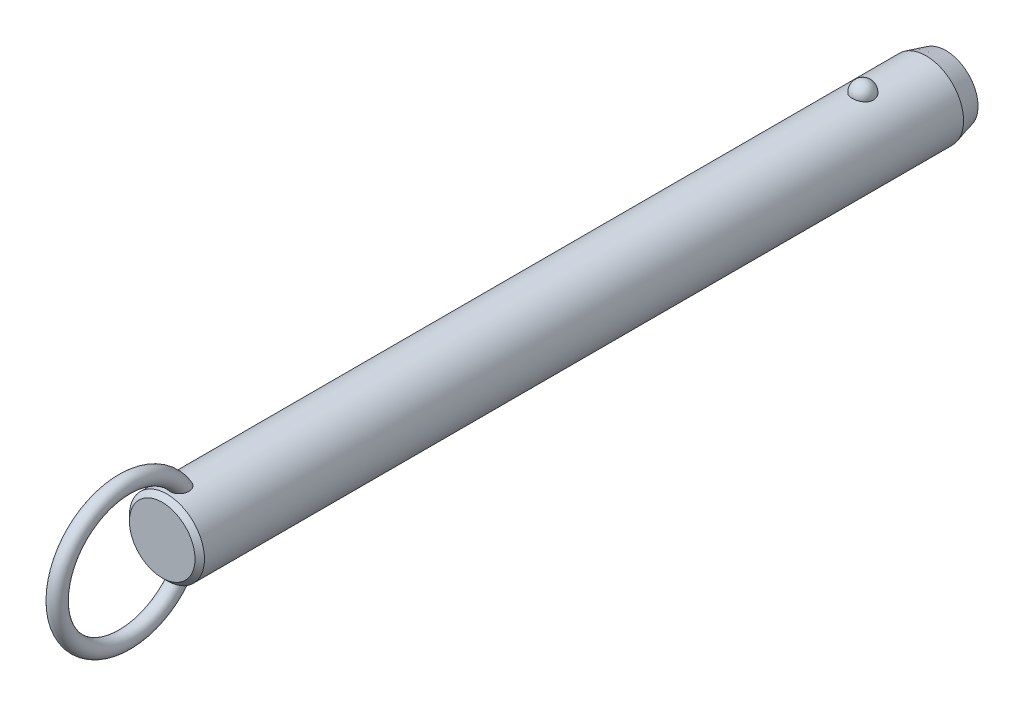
ISO-10303-21;
HEADER;
FILE_DESCRIPTION(('STEP AP214'),'2;1');
FILE_NAME('part.step','',(''),(''),'','','');
FILE_SCHEMA(('AUTOMOTIVE_DESIGN { 1 0 10303 214 1 1 1 1 }'));
ENDSEC;
DATA;
#1=APPLICATION_CONTEXT('core data for automotive mechanical design processes');
#2=APPLICATION_PROTOCOL_DEFINITION('international standard','automotive_design',2000,#1);
#3=PRODUCT_CONTEXT('',#1,'mechanical');
#4=PRODUCT('Part','Part','',(#3));
#5=PRODUCT_RELATED_PRODUCT_CATEGORY('part','',(#4));
#6=PRODUCT_DEFINITION_FORMATION('','',#4);
#7=PRODUCT_DEFINITION_CONTEXT('part definition',#1,'design');
#8=PRODUCT_DEFINITION('design','',#6,#7);
#9=PRODUCT_DEFINITION_SHAPE('','',#8);
#10=(LENGTH_UNIT() NAMED_UNIT(*) SI_UNIT(.MILLI.,.METRE.));
#11=(NAMED_UNIT(*) PLANE_ANGLE_UNIT() SI_UNIT($,.RADIAN.));
#12=(NAMED_UNIT(*) SI_UNIT($,.STERADIAN.) SOLID_ANGLE_UNIT());
#13=UNCERTAINTY_MEASURE_WITH_UNIT(LENGTH_MEASURE(1.E-05),#10,'distance_accuracy_value','');
#14=(GEOMETRIC_REPRESENTATION_CONTEXT(3) GLOBAL_UNCERTAINTY_ASSIGNED_CONTEXT((#13)) GLOBAL_UNIT_ASSIGNED_CONTEXT((#10,
#11,#12)) REPRESENTATION_CONTEXT('',''));
#15=CARTESIAN_POINT('',(0.,0.,0.));
#16=DIRECTION('',(0.,0.,1.));
#17=DIRECTION('',(1.,0.,0.));
#18=AXIS2_PLACEMENT_3D('',#15,#16,#17);
#19=CARTESIAN_POINT('',(0.,0.,165.1));
#20=DIRECTION('',(0.,0.,-1.));
#21=DIRECTION('',(-1.,0.,0.));
#22=AXIS2_PLACEMENT_3D('',#19,#20,#21);
#23=CYLINDRICAL_SURFACE('',#22,9.5);
#24=CARTESIAN_POINT('',(2.67259918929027,9.11631578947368,-2.70000000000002));
#25=CARTESIAN_POINT('',(2.6725968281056,9.11631786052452,-2.54909854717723));
#26=CARTESIAN_POINT('',(2.66030567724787,9.11994722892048,-2.39816735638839));
#27=CARTESIAN_POINT('',(2.6114347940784,9.13405924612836,-2.10058568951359));
#28=CARTESIAN_POINT('',(2.57484658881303,9.14454428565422,-1.95393672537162));
#29=CARTESIAN_POINT('',(2.47830875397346,9.17117631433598,-1.66916069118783));
#30=CARTESIAN_POINT('',(2.41836936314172,9.18732082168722,-1.53102991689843));
#31=CARTESIAN_POINT('',(2.27661331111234,9.22346780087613,-1.26705393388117));
#32=CARTESIAN_POINT('',(2.19479699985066,9.24347021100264,-1.14120852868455));
#33=CARTESIAN_POINT('',(2.01085282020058,9.28522401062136,-0.904632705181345));
#34=CARTESIAN_POINT('',(1.90862396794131,9.30698376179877,-0.79398224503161));
#35=CARTESIAN_POINT('',(1.6867437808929,9.34973971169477,-0.591607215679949));
#36=CARTESIAN_POINT('',(1.56709244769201,9.37073591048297,-0.499882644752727));
#37=CARTESIAN_POINT('',(1.31393976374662,9.40956370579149,-0.338167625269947));
#38=CARTESIAN_POINT('',(1.18048026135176,9.42740444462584,-0.268113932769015));
#39=CARTESIAN_POINT('',(0.903154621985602,9.45799906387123,-0.151390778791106));
#40=CARTESIAN_POINT('',(0.759289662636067,9.47075351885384,-0.104718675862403));
#41=CARTESIAN_POINT('',(0.46807402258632,9.48956256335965,-0.0367633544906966));
#42=CARTESIAN_POINT('',(0.320836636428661,9.49573643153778,-0.0150275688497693));
#43=CARTESIAN_POINT('',(0.0246714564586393,9.50112183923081,0.0039619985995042));
#44=CARTESIAN_POINT('',(-0.124256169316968,9.50033406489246,0.00121819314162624));
#45=CARTESIAN_POINT('',(-0.417264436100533,9.4919475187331,-0.0284441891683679));
#46=CARTESIAN_POINT('',(-0.561384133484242,9.48444885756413,-0.0550074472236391));
#47=CARTESIAN_POINT('',(-0.842986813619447,9.46357853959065,-0.131064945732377));
#48=CARTESIAN_POINT('',(-0.98046968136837,9.450206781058,-0.180559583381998));
#49=CARTESIAN_POINT('',(-1.24585005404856,9.41890822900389,-0.301476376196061));
#50=CARTESIAN_POINT('',(-1.37368611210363,9.40095498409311,-0.373026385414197));
#51=CARTESIAN_POINT('',(-1.61552738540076,9.36242964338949,-0.53602540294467));
#52=CARTESIAN_POINT('',(-1.72953116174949,9.34185727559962,-0.627476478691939));
#53=CARTESIAN_POINT('',(-1.9429225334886,9.29984568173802,-0.829844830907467));
#54=CARTESIAN_POINT('',(-2.04198021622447,9.27839736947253,-0.941108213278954));
#55=CARTESIAN_POINT('',(-2.2202646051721,9.23735994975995,-1.17883414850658));
#56=CARTESIAN_POINT('',(-2.29948985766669,9.21777097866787,-1.30529781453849));
#57=CARTESIAN_POINT('',(-2.43697287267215,9.18238994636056,-1.57158566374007));
#58=CARTESIAN_POINT('',(-2.49497068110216,9.16664569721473,-1.71155057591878));
#59=CARTESIAN_POINT('',(-2.5872073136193,9.14104303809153,-1.99961197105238));
#60=CARTESIAN_POINT('',(-2.62144683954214,9.13118445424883,-2.1477082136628));
#61=CARTESIAN_POINT('',(-2.66521466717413,9.11850622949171,-2.44715424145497));
#62=CARTESIAN_POINT('',(-2.67484831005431,9.11565658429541,-2.59848735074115));
#63=CARTESIAN_POINT('',(-2.66946735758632,9.11723375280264,-2.90067317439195));
#64=CARTESIAN_POINT('',(-2.65445345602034,9.12166036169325,-3.05152590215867));
#65=CARTESIAN_POINT('',(-2.60029711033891,9.13724422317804,-3.34766110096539));
#66=CARTESIAN_POINT('',(-2.56127978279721,9.14836656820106,-3.49296833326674));
#67=CARTESIAN_POINT('',(-2.46018844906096,9.17606676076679,-3.77477535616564));
#68=CARTESIAN_POINT('',(-2.39811349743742,9.19264483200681,-3.91127478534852));
#69=CARTESIAN_POINT('',(-2.25202303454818,9.22952198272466,-4.17244273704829));
#70=CARTESIAN_POINT('',(-2.16788714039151,9.24984129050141,-4.29704106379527));
#71=CARTESIAN_POINT('',(-1.9799408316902,9.29188255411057,-4.53013066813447));
#72=CARTESIAN_POINT('',(-1.87612963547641,9.31360456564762,-4.63862130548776));
#73=CARTESIAN_POINT('',(-1.65105429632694,9.35612959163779,-4.83690299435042));
#74=CARTESIAN_POINT('',(-1.52972405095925,9.37692871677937,-4.9266199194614));
#75=CARTESIAN_POINT('',(-1.27318250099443,9.41518970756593,-5.08429106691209));
#76=CARTESIAN_POINT('',(-1.13797219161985,9.432651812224,-5.15224684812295));
#77=CARTESIAN_POINT('',(-0.859280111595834,9.46208255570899,-5.26371827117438));
#78=CARTESIAN_POINT('',(-0.715925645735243,9.47411833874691,-5.30753421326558));
#79=CARTESIAN_POINT('',(-0.423550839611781,9.4916822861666,-5.37076321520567));
#80=CARTESIAN_POINT('',(-0.274531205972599,9.49721125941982,-5.39017930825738));
#81=CARTESIAN_POINT('',(0.0218446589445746,9.50110860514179,-5.40390587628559));
#82=CARTESIAN_POINT('',(0.169177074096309,9.49961381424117,-5.39869609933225));
#83=CARTESIAN_POINT('',(0.460808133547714,9.48993906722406,-5.36441955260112));
#84=CARTESIAN_POINT('',(0.605106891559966,9.48175936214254,-5.33535367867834));
#85=CARTESIAN_POINT('',(0.886027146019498,9.4596376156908,-5.25435587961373));
#86=CARTESIAN_POINT('',(1.02267710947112,9.44571881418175,-5.20251612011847));
#87=CARTESIAN_POINT('',(1.28523827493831,9.41358993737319,-5.07741549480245));
#88=CARTESIAN_POINT('',(1.41114877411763,9.39537958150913,-5.00415322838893));
#89=CARTESIAN_POINT('',(1.65085227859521,9.3562644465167,-4.83684599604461));
#90=CARTESIAN_POINT('',(1.76442346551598,9.33532178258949,-4.74249218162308));
#91=CARTESIAN_POINT('',(1.97425672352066,9.29321198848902,-4.53620389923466));
#92=CARTESIAN_POINT('',(2.07051582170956,9.27204482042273,-4.42426641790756));
#93=CARTESIAN_POINT('',(2.24490086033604,9.23139221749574,-4.18363183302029));
#94=CARTESIAN_POINT('',(2.32267019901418,9.21194380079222,-4.05466990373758));
#95=CARTESIAN_POINT('',(2.45584092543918,9.1773419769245,-3.78517836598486));
#96=CARTESIAN_POINT('',(2.5112497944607,9.16218713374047,-3.644652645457));
#97=CARTESIAN_POINT('',(2.59380876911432,9.13913522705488,-3.37104301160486));
#98=CARTESIAN_POINT('',(2.62330266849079,9.13064624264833,-3.23871053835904));
#99=CARTESIAN_POINT('',(2.66269870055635,9.11923566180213,-2.97092664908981));
#100=CARTESIAN_POINT('',(2.67260130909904,9.11631393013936,-2.83547530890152));
#101=CARTESIAN_POINT('',(2.67259918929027,9.11631578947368,-2.70000000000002));
#102=B_SPLINE_CURVE_WITH_KNOTS('',3,(#24,#25,#26,#27,#28,#29,#30,#31,#32,#33,#34,#35,#36,#37,
#38,#39,#40,#41,#42,#43,#44,#45,#46,#47,#48,#49,#50,#51,#52,#53,#54,#55,#56,#57,#58,#59,#60,#61,
#62,#63,#64,#65,#66,#67,#68,#69,#70,#71,#72,#73,#74,#75,#76,#77,#78,#79,#80,#81,#82,#83,#84,#85,
#86,#87,#88,#89,#90,#91,#92,#93,#94,#95,#96,#97,#98,#99,#100,#101),.UNSPECIFIED.,.T.,.F.,(4,2,2,
2,2,2,2,2,2,2,2,2,2,2,2,2,2,2,2,2,2,2,2,2,2,2,2,2,2,2,2,2,2,2,2,2,2,2,4),(0.,0.452217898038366,
0.904593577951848,1.35677112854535,1.80894144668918,2.26340676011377,2.71787203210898,
3.17099820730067,3.62407318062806,4.0687883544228,4.51345969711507,4.95160616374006,
5.38976021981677,5.83050358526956,6.27129275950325,6.72071308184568,7.17016633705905,
7.62495278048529,8.07972578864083,8.53254856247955,8.98535859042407,9.43582813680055,
9.88631615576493,10.3393155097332,10.7923328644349,11.2471065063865,11.7018475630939,
12.150795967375,12.599688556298,13.0398725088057,13.4800399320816,13.9184421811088,
14.3568730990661,14.802202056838,15.2476074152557,15.7010097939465,16.1542603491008,
16.5602594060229,16.9662486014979),.UNSPECIFIED.);
#103=CARTESIAN_POINT('',(2.67259918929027,9.11631578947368,-2.70000000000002));
#104=VERTEX_POINT('',#103);
#105=EDGE_CURVE('E41',#104,#104,#102,.T.);
#106=ORIENTED_EDGE('',*,*,#105,.T.);
#107=EDGE_LOOP('',(#106));
#108=FACE_BOUND('',#107,.T.);
#109=CARTESIAN_POINT('',(0.,0.,173.42));
#110=DIRECTION('',(0.,0.,1.));
#111=DIRECTION('',(1.,0.,0.));
#112=AXIS2_PLACEMENT_3D('',#109,#110,#111);
#113=CIRCLE('',#112,9.5);
#114=CARTESIAN_POINT('',(9.5,0.,173.42));
#115=VERTEX_POINT('',#114);
#116=EDGE_CURVE('E10',#115,#115,#113,.F.);
#117=ORIENTED_EDGE('',*,*,#116,.T.);
#118=EDGE_LOOP('',(#117));
#119=FACE_BOUND('',#118,.T.);
#120=CARTESIAN_POINT('',(-0.697062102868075,-9.47439269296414,167.767808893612));
#121=CARTESIAN_POINT('',(-0.799579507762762,-9.46685146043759,167.807482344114));
#122=CARTESIAN_POINT('',(-0.898575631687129,-9.45788043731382,167.8559309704));
#123=CARTESIAN_POINT('',(-1.08670047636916,-9.43811593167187,167.968868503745));
#124=CARTESIAN_POINT('',(-1.17583204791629,-9.42732297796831,168.033352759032));
#125=CARTESIAN_POINT('',(-1.34179806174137,-9.40513672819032,168.176209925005));
#126=CARTESIAN_POINT('',(-1.41865133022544,-9.39374438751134,168.254561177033));
#127=CARTESIAN_POINT('',(-1.55860047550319,-9.37154196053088,168.422752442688));
#128=CARTESIAN_POINT('',(-1.62169476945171,-9.3607319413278,168.51259377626));
#129=CARTESIAN_POINT('',(-1.73527695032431,-9.34035749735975,168.704500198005));
#130=CARTESIAN_POINT('',(-1.78522266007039,-9.33085270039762,168.806891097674));
#131=CARTESIAN_POINT('',(-1.86924997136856,-9.3143834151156,169.018148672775));
#132=CARTESIAN_POINT('',(-1.90332570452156,-9.30741986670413,169.127017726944));
#133=CARTESIAN_POINT('',(-1.95893603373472,-9.29588482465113,169.360473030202));
#134=CARTESIAN_POINT('',(-1.97872420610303,-9.29165182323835,169.485489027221));
#135=CARTESIAN_POINT('',(-2.00062129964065,-9.28695978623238,169.737080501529));
#136=CARTESIAN_POINT('',(-2.00272284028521,-9.28650232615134,169.863656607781));
#137=CARTESIAN_POINT('',(-1.98958876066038,-9.28932750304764,170.136815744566));
#138=CARTESIAN_POINT('',(-1.97143366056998,-9.2932400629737,170.283251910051));
#139=CARTESIAN_POINT('',(-1.91479925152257,-9.30507151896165,170.572062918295));
#140=CARTESIAN_POINT('',(-1.87629122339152,-9.31299607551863,170.714431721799));
#141=CARTESIAN_POINT('',(-1.77225683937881,-9.33340232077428,171.015172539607));
#142=CARTESIAN_POINT('',(-1.70334898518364,-9.34641636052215,171.172369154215));
#143=CARTESIAN_POINT('',(-1.58111062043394,-9.36759153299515,171.397517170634));
#144=CARTESIAN_POINT('',(-1.53721459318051,-9.37492619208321,171.470796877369));
#145=CARTESIAN_POINT('',(-1.44302631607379,-9.38988566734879,171.61307405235));
#146=CARTESIAN_POINT('',(-1.39273721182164,-9.39751033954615,171.682073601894));
#147=CARTESIAN_POINT('',(-1.26775962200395,-9.41530678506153,171.836983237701));
#148=CARTESIAN_POINT('',(-1.19052326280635,-9.42548108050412,171.920871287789));
#149=CARTESIAN_POINT('',(-1.02420241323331,-9.44499825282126,172.076008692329));
#150=CARTESIAN_POINT('',(-0.935139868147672,-9.45434261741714,172.147280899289));
#151=CARTESIAN_POINT('',(-0.76661041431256,-9.46930670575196,172.258695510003));
#152=CARTESIAN_POINT('',(-0.689439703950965,-9.47529223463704,172.302235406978));
#153=CARTESIAN_POINT('',(-0.528942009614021,-9.48560294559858,172.37631336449));
#154=CARTESIAN_POINT('',(-0.445620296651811,-9.48992953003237,172.406862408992));
#155=CARTESIAN_POINT('',(-0.273901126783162,-9.49644161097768,172.452579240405));
#156=CARTESIAN_POINT('',(-0.18546574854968,-9.49860811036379,172.46761059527));
#157=CARTESIAN_POINT('',(-0.00734541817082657,-9.5004135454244,172.480149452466));
#158=CARTESIAN_POINT('',(0.082338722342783,-9.50005405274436,172.477667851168));
#159=CARTESIAN_POINT('',(0.247679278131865,-9.49708301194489,172.456995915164));
#160=CARTESIAN_POINT('',(0.323620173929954,-9.49477609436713,172.440930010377));
#161=CARTESIAN_POINT('',(0.471981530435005,-9.48855917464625,172.397172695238));
#162=CARTESIAN_POINT('',(0.544400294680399,-9.48464840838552,172.369475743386));
#163=CARTESIAN_POINT('',(0.708947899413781,-9.47398336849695,172.29280266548));
#164=CARTESIAN_POINT('',(0.799149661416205,-9.46671310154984,172.239774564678));
#165=CARTESIAN_POINT('',(0.969783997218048,-9.45076225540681,172.119973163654));
#166=CARTESIAN_POINT('',(1.05019415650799,-9.44207854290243,172.053169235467));
#167=CARTESIAN_POINT('',(1.23092343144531,-9.42051459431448,171.880759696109));
#168=CARTESIAN_POINT('',(1.32652499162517,-9.40733378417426,171.77026193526));
#169=CARTESIAN_POINT('',(1.49893121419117,-9.38140745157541,171.535561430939));
#170=CARTESIAN_POINT('',(1.57571616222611,-9.36866239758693,171.411344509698));
#171=CARTESIAN_POINT('',(1.71285426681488,-9.34457644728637,171.149389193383));
#172=CARTESIAN_POINT('',(1.77266365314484,-9.33328726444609,171.01136233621));
#173=CARTESIAN_POINT('',(1.87239208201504,-9.31379209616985,170.728051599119));
#174=CARTESIAN_POINT('',(1.91230158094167,-9.30558759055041,170.582764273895));
#175=CARTESIAN_POINT('',(1.97604189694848,-9.29228394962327,170.262028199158));
#176=CARTESIAN_POINT('',(1.9958743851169,-9.28797202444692,170.085724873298));
#177=CARTESIAN_POINT('',(2.00295708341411,-9.28645519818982,169.732414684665));
#178=CARTESIAN_POINT('',(1.99025930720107,-9.28923895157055,169.555409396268));
#179=CARTESIAN_POINT('',(1.93735479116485,-9.30038134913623,169.256338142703));
#180=CARTESIAN_POINT('',(1.90576827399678,-9.30697680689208,169.132667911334));
#181=CARTESIAN_POINT('',(1.82287484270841,-9.32356855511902,168.892329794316));
#182=CARTESIAN_POINT('',(1.77158213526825,-9.33356239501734,168.775656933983));
#183=CARTESIAN_POINT('',(1.64885744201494,-9.35602275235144,168.552706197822));
#184=CARTESIAN_POINT('',(1.57730995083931,-9.36850332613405,168.446492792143));
#185=CARTESIAN_POINT('',(1.41543264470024,-9.39431873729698,168.249553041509));
#186=CARTESIAN_POINT('',(1.32510883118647,-9.40765330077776,168.158821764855));
#187=CARTESIAN_POINT('',(1.13846223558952,-9.43195720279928,168.005033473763));
#188=CARTESIAN_POINT('',(1.04369890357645,-9.44302894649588,167.940094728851));
#189=CARTESIAN_POINT('',(0.843965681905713,-9.46296805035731,167.828038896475));
#190=CARTESIAN_POINT('',(0.739000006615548,-9.47183631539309,167.780914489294));
#191=CARTESIAN_POINT('',(0.528175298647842,-9.48586140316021,167.708117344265));
#192=CARTESIAN_POINT('',(0.422686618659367,-9.49119633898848,167.68140249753));
#193=CARTESIAN_POINT('',(0.208590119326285,-9.49831365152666,167.646013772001));
#194=CARTESIAN_POINT('',(0.0999817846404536,-9.500095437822,167.637342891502));
#195=CARTESIAN_POINT('',(-0.126104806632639,-9.49988861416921,167.638350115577));
#196=CARTESIAN_POINT('',(-0.243578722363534,-9.49757821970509,167.649594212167));
#197=CARTESIAN_POINT('',(-0.474390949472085,-9.48885165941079,167.693167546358));
#198=CARTESIAN_POINT('',(-0.587729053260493,-9.48243528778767,167.725497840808));
#199=CARTESIAN_POINT('',(-0.697062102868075,-9.47439269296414,167.767808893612));
#200=B_SPLINE_CURVE_WITH_KNOTS('',3,(#120,#121,#122,#123,#124,#125,#126,#127,#128,#129,#130,
#131,#132,#133,#134,#135,#136,#137,#138,#139,#140,#141,#142,#143,#144,#145,#146,#147,#148,#149,
#150,#151,#152,#153,#154,#155,#156,#157,#158,#159,#160,#161,#162,#163,#164,#165,#166,#167,#168,
#169,#170,#171,#172,#173,#174,#175,#176,#177,#178,#179,#180,#181,#182,#183,#184,#185,#186,#187,
#188,#189,#190,#191,#192,#193,#194,#195,#196,#197,#198,#199),.UNSPECIFIED.,.T.,.F.,(4,2,2,2,2,2,
2,2,2,2,2,2,2,2,2,2,2,2,2,2,2,2,2,2,2,2,2,2,2,2,2,2,2,2,2,2,2,2,2,4),(0.,0.330119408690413,
0.6601431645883,0.98965593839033,1.31920659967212,1.660747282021,2.00241415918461,
2.38088696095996,2.75951768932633,3.20065679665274,3.64242004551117,4.15620996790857,
4.41314162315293,4.66994734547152,5.0122866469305,5.35399933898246,5.61943037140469,
5.88463652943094,6.15215502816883,6.41950709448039,6.65144391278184,6.88349136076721,
7.19641200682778,7.51003602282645,7.94779711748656,8.3860149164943,8.83699707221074,
9.28819530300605,9.81778662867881,10.34653170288,10.7284172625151,11.1100280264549,
11.4938603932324,11.8775702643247,12.2220189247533,12.5663259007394,12.8915939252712,
13.2169159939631,13.5689650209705,13.9210316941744),.UNSPECIFIED.);
#201=CARTESIAN_POINT('',(-0.697062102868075,-9.47439269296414,167.767808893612));
#202=VERTEX_POINT('',#201);
#203=EDGE_CURVE('E60',#202,#202,#200,.T.);
#204=ORIENTED_EDGE('',*,*,#203,.T.);
#205=EDGE_LOOP('',(#204));
#206=FACE_BOUND('',#205,.T.);
#207=CARTESIAN_POINT('',(-0.697062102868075,9.47439269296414,167.767808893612));
#208=CARTESIAN_POINT('',(-0.597792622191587,9.48169483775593,167.72939564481));
#209=CARTESIAN_POINT('',(-0.495106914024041,9.48766580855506,167.699168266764));
#210=CARTESIAN_POINT('',(-0.285876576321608,9.49627648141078,167.656032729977));
#211=CARTESIAN_POINT('',(-0.179324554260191,9.49890941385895,167.643159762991));
#212=CARTESIAN_POINT('',(0.0344157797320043,9.50053798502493,167.635166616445));
#213=CARTESIAN_POINT('',(0.14160360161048,9.49953613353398,167.640034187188));
#214=CARTESIAN_POINT('',(0.353563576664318,9.49401038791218,167.667365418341));
#215=CARTESIAN_POINT('',(0.458336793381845,9.48948807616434,167.68982117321));
#216=CARTESIAN_POINT('',(0.662493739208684,9.4774236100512,167.751671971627));
#217=CARTESIAN_POINT('',(0.761881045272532,9.46988348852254,167.791055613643));
#218=CARTESIAN_POINT('',(0.952608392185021,9.45260382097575,167.885634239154));
#219=CARTESIAN_POINT('',(1.04394806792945,9.44286417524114,167.940829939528));
#220=CARTESIAN_POINT('',(1.21712767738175,9.42211760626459,168.066066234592));
#221=CARTESIAN_POINT('',(1.29885671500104,9.41109835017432,168.136257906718));
#222=CARTESIAN_POINT('',(1.44978975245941,9.38903310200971,168.288980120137));
#223=CARTESIAN_POINT('',(1.51899278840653,9.37798710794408,168.371511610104));
#224=CARTESIAN_POINT('',(1.64602857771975,9.35654375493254,168.549776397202));
#225=CARTESIAN_POINT('',(1.70333052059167,9.34618688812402,168.645891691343));
#226=CARTESIAN_POINT('',(1.80259341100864,9.32755128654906,168.845897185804));
#227=CARTESIAN_POINT('',(1.84454942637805,9.31927322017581,168.949789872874));
#228=CARTESIAN_POINT('',(1.91637039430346,9.30478365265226,169.172213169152));
#229=CARTESIAN_POINT('',(1.944805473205,9.29882552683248,169.291219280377));
#230=CARTESIAN_POINT('',(1.98449865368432,9.29043398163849,169.532143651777));
#231=CARTESIAN_POINT('',(1.99574908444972,9.28800213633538,169.654063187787));
#232=CARTESIAN_POINT('',(2.00275141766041,9.28649645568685,169.916932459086));
#233=CARTESIAN_POINT('',(1.99588238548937,9.28799035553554,170.057952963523));
#234=CARTESIAN_POINT('',(1.96270559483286,9.29505517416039,170.337621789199));
#235=CARTESIAN_POINT('',(1.93637872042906,9.30063010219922,170.476267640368));
#236=CARTESIAN_POINT('',(1.85949176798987,9.31633564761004,170.772561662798));
#237=CARTESIAN_POINT('',(1.80549792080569,9.3270926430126,170.929290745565));
#238=CARTESIAN_POINT('',(1.67376869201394,9.3516306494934,171.232284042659));
#239=CARTESIAN_POINT('',(1.59603181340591,9.36541185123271,171.378547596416));
#240=CARTESIAN_POINT('',(1.4360277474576,9.39110706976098,171.625813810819));
#241=CARTESIAN_POINT('',(1.35831795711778,9.40278656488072,171.729791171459));
#242=CARTESIAN_POINT('',(1.18774483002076,9.42585025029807,171.924534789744));
#243=CARTESIAN_POINT('',(1.09490932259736,9.43723493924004,172.015324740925));
#244=CARTESIAN_POINT('',(0.921110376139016,9.45552616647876,172.15620334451));
#245=CARTESIAN_POINT('',(0.843738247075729,9.46281058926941,172.210656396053));
#246=CARTESIAN_POINT('',(0.681245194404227,9.47589120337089,172.306711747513));
#247=CARTESIAN_POINT('',(0.596135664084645,9.48168953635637,172.348332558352));
#248=CARTESIAN_POINT('',(0.433779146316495,9.49038144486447,172.410089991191));
#249=CARTESIAN_POINT('',(0.35745955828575,9.49359170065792,172.43260136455));
#250=CARTESIAN_POINT('',(0.202074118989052,9.49816761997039,172.464574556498));
#251=CARTESIAN_POINT('',(0.123010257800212,9.49953459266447,172.474045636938));
#252=CARTESIAN_POINT('',(-0.0357372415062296,9.50026497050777,172.479114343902));
#253=CARTESIAN_POINT('',(-0.115421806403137,9.49962433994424,172.474684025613));
#254=CARTESIAN_POINT('',(-0.272823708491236,9.49640854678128,172.452296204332));
#255=CARTESIAN_POINT('',(-0.350540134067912,9.4938325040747,172.434332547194));
#256=CARTESIAN_POINT('',(-0.500580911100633,9.48709462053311,172.386802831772));
#257=CARTESIAN_POINT('',(-0.572979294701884,9.48296359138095,172.357461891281));
#258=CARTESIAN_POINT('',(-0.712864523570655,9.47347609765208,172.289008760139));
#259=CARTESIAN_POINT('',(-0.780349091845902,9.46811906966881,172.249892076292));
#260=CARTESIAN_POINT('',(-0.946309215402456,9.45329720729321,172.139432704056));
#261=CARTESIAN_POINT('',(-1.04090230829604,9.44321512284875,172.062329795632));
#262=CARTESIAN_POINT('',(-1.21661929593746,9.42219227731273,171.89409718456));
#263=CARTESIAN_POINT('',(-1.29770519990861,9.41124921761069,171.802929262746));
#264=CARTESIAN_POINT('',(-1.47319646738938,9.38563439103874,171.576162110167));
#265=CARTESIAN_POINT('',(-1.5620887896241,9.37102009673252,171.436289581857));
#266=CARTESIAN_POINT('',(-1.71623987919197,9.34401559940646,171.143950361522));
#267=CARTESIAN_POINT('',(-1.7814786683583,9.33162728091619,170.991473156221));
#268=CARTESIAN_POINT('',(-1.88853837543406,9.31055541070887,170.675647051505));
#269=CARTESIAN_POINT('',(-1.92998995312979,9.30193076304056,170.512168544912));
#270=CARTESIAN_POINT('',(-1.98590726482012,9.29015757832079,170.180526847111));
#271=CARTESIAN_POINT('',(-2.0004070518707,9.2870021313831,170.012369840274));
#272=CARTESIAN_POINT('',(-1.99964701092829,9.28716218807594,169.705080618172));
#273=CARTESIAN_POINT('',(-1.98908145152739,9.28945704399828,169.565936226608));
#274=CARTESIAN_POINT('',(-1.94566294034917,9.29865169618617,169.291153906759));
#275=CARTESIAN_POINT('',(-1.91282062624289,9.30554929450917,169.155514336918));
#276=CARTESIAN_POINT('',(-1.84582133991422,9.31898248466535,168.957802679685));
#277=CARTESIAN_POINT('',(-1.82038084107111,9.32400364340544,168.892583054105));
#278=CARTESIAN_POINT('',(-1.7635051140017,9.33492884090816,168.764903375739));
#279=CARTESIAN_POINT('',(-1.73207305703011,9.34083241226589,168.702441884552));
#280=CARTESIAN_POINT('',(-1.66324243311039,9.353333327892,168.58094078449));
#281=CARTESIAN_POINT('',(-1.62584239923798,9.35993084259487,168.521902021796));
#282=CARTESIAN_POINT('',(-1.54527678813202,9.37356864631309,168.407987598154));
#283=CARTESIAN_POINT('',(-1.50211241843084,9.38060884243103,168.353111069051));
#284=CARTESIAN_POINT('',(-1.37681147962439,9.40004442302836,168.209961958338));
#285=CARTESIAN_POINT('',(-1.28916358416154,9.41261047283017,168.126429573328));
#286=CARTESIAN_POINT('',(-1.09996826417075,9.43658180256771,167.977236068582));
#287=CARTESIAN_POINT('',(-0.99846185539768,9.44799034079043,167.911523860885));
#288=CARTESIAN_POINT('',(-0.860188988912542,9.46103017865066,167.8394367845));
#289=CARTESIAN_POINT('',(-0.828141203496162,9.46389141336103,167.823851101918));
#290=CARTESIAN_POINT('',(-0.763210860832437,9.46934915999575,167.794473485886));
#291=CARTESIAN_POINT('',(-0.730328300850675,9.47194567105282,167.780681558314));
#292=CARTESIAN_POINT('',(-0.697062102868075,9.47439269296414,167.767808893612));
#293=B_SPLINE_CURVE_WITH_KNOTS('',3,(#207,#208,#209,#210,#211,#212,#213,#214,#215,#216,#217,
#218,#219,#220,#221,#222,#223,#224,#225,#226,#227,#228,#229,#230,#231,#232,#233,#234,#235,#236,
#237,#238,#239,#240,#241,#242,#243,#244,#245,#246,#247,#248,#249,#250,#251,#252,#253,#254,#255,
#256,#257,#258,#259,#260,#261,#262,#263,#264,#265,#266,#267,#268,#269,#270,#271,#272,#273,#274,
#275,#276,#277,#278,#279,#280,#281,#282,#283,#284,#285,#286,#287,#288,#289,#290,#291,#292),
.UNSPECIFIED.,.T.,.F.,(4,2,2,2,2,2,2,2,2,2,2,2,2,2,2,2,2,2,2,2,2,2,2,2,2,2,2,2,2,2,2,2,2,2,2,2,
2,2,2,2,2,2,4),(0.,0.319942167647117,0.640532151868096,0.960900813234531,1.28112555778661,
1.60113495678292,1.92115886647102,2.24457323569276,2.56801248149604,2.90371927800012,
3.23953387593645,3.60560313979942,3.97183576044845,4.39383693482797,4.81625324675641,
5.31257045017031,5.80891895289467,6.19868344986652,6.58773876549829,6.87145417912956,
7.15475838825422,7.3926375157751,7.63034760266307,7.86853584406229,8.10683246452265,
8.34063661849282,8.57454843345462,8.93983939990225,9.30614105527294,9.80266668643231,
10.2996107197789,10.8040753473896,11.3079021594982,11.7249776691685,12.1418541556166,
12.3521485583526,12.5623319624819,12.7725671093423,12.9827582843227,13.345827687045,
13.7078449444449,13.8150604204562,13.9222762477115),.UNSPECIFIED.);
#294=CARTESIAN_POINT('',(-0.697062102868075,9.47439269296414,167.767808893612));
#295=VERTEX_POINT('',#294);
#296=EDGE_CURVE('E68',#295,#295,#293,.T.);
#297=ORIENTED_EDGE('',*,*,#296,.T.);
#298=EDGE_LOOP('',(#297));
#299=FACE_BOUND('',#298,.T.);
#300=CARTESIAN_POINT('',(0.,0.,-18.6999999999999));
#301=DIRECTION('',(0.,0.,-1.));
#302=DIRECTION('',(-1.,0.,0.));
#303=AXIS2_PLACEMENT_3D('',#300,#301,#302);
#304=CIRCLE('',#303,9.5);
#305=CARTESIAN_POINT('',(-9.5,0.,-18.6999999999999));
#306=VERTEX_POINT('',#305);
#307=EDGE_CURVE('E57',#306,#306,#304,.F.);
#308=ORIENTED_EDGE('',*,*,#307,.T.);
#309=EDGE_LOOP('',(#308));
#310=FACE_BOUND('',#309,.T.);
#311=ADVANCED_FACE('F37',(#108,#119,#206,#299,#310),#23,.T.);
#312=CARTESIAN_POINT('',(0.,0.,-23.7));
#313=DIRECTION('',(0.,0.,-1.));
#314=DIRECTION('',(-1.,0.,0.));
#315=AXIS2_PLACEMENT_3D('',#312,#313,#314);
#316=PLANE('',#315);
#317=CARTESIAN_POINT('',(0.,0.,-23.7));
#318=DIRECTION('',(0.,0.,-1.));
#319=DIRECTION('',(-1.,0.,0.));
#320=AXIS2_PLACEMENT_3D('',#317,#318,#319);
#321=CIRCLE('',#320,8.16025403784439);
#322=CARTESIAN_POINT('',(-8.16025403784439,0.,-23.7));
#323=VERTEX_POINT('',#322);
#324=EDGE_CURVE('E67',#323,#323,#321,.T.);
#325=ORIENTED_EDGE('',*,*,#324,.T.);
#326=EDGE_LOOP('',(#325));
#327=FACE_BOUND('',#326,.T.);
#328=ADVANCED_FACE('F86',(#327),#316,.T.);
#329=CARTESIAN_POINT('',(0.,0.,-23.7));
#330=DIRECTION('',(0.,0.,1.));
#331=DIRECTION('',(1.,0.,0.));
#332=AXIS2_PLACEMENT_3D('',#329,#330,#331);
#333=CONICAL_SURFACE('',#332,8.16025403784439,0.261799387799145);
#334=ORIENTED_EDGE('',*,*,#307,.F.);
#335=EDGE_LOOP('',(#334));
#336=FACE_BOUND('',#335,.T.);
#337=ORIENTED_EDGE('',*,*,#324,.F.);
#338=EDGE_LOOP('',(#337));
#339=FACE_BOUND('',#338,.T.);
#340=ADVANCED_FACE('F84',(#336,#339),#333,.T.);
#341=CARTESIAN_POINT('',(0.,0.,174.62));
#342=DIRECTION('',(0.,0.,1.));
#343=DIRECTION('',(1.,0.,0.));
#344=AXIS2_PLACEMENT_3D('',#341,#342,#343);
#345=PLANE('',#344);
#346=CARTESIAN_POINT('',(0.,0.,174.62));
#347=DIRECTION('',(0.,0.,1.));
#348=DIRECTION('',(1.,0.,0.));
#349=AXIS2_PLACEMENT_3D('',#346,#347,#348);
#350=CIRCLE('',#349,8.3);
#351=CARTESIAN_POINT('',(8.3,0.,174.62));
#352=VERTEX_POINT('',#351);
#353=EDGE_CURVE('E50',#352,#352,#350,.T.);
#354=ORIENTED_EDGE('',*,*,#353,.T.);
#355=EDGE_LOOP('',(#354));
#356=FACE_BOUND('',#355,.T.);
#357=ADVANCED_FACE('F78',(#356),#345,.T.);
#358=CARTESIAN_POINT('',(0.,0.,184.15));
#359=DIRECTION('',(1.,0.,0.));
#360=DIRECTION('',(0.,0.,-1.));
#361=AXIS2_PLACEMENT_3D('',#358,#359,#360);
#362=TOROIDAL_SURFACE('',#361,17.05,2.);
#363=ORIENTED_EDGE('',*,*,#296,.F.);
#364=EDGE_LOOP('',(#363));
#365=FACE_BOUND('',#364,.T.);
#366=ORIENTED_EDGE('',*,*,#203,.F.);
#367=EDGE_LOOP('',(#366));
#368=FACE_BOUND('',#367,.T.);
#369=ADVANCED_FACE('F74',(#365,#368),#362,.T.);
#370=CARTESIAN_POINT('',(0.,0.,174.62));
#371=DIRECTION('',(0.,0.,-1.));
#372=DIRECTION('',(-1.,0.,0.));
#373=AXIS2_PLACEMENT_3D('',#370,#371,#372);
#374=CONICAL_SURFACE('',#373,8.3,0.785398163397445);
#375=ORIENTED_EDGE('',*,*,#116,.F.);
#376=EDGE_LOOP('',(#375));
#377=FACE_BOUND('',#376,.T.);
#378=ORIENTED_EDGE('',*,*,#353,.F.);
#379=EDGE_LOOP('',(#378));
#380=FACE_BOUND('',#379,.T.);
#381=ADVANCED_FACE('F39',(#377,#380),#374,.T.);
#382=CARTESIAN_POINT('',(0.,9.5,-2.70000000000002));
#383=DIRECTION('',(0.,1.,0.));
#384=DIRECTION('',(0.,0.,1.));
#385=AXIS2_PLACEMENT_3D('',#382,#383,#384);
#386=SPHERICAL_SURFACE('',#385,2.7);
#387=ORIENTED_EDGE('',*,*,#105,.F.);
#388=EDGE_LOOP('',(#387));
#389=FACE_BOUND('',#388,.T.);
#390=ADVANCED_FACE('F80',(#389),#386,.T.);
#391=CLOSED_SHELL('',(#311,#328,#340,#357,#369,#381,#390));
#392=MANIFOLD_SOLID_BREP('B2',#391);
#393=ADVANCED_BREP_SHAPE_REPRESENTATION('',(#18,#392),#14);
#394=SHAPE_DEFINITION_REPRESENTATION(#9,#393);
ENDSEC;
END-ISO-10303-21;
